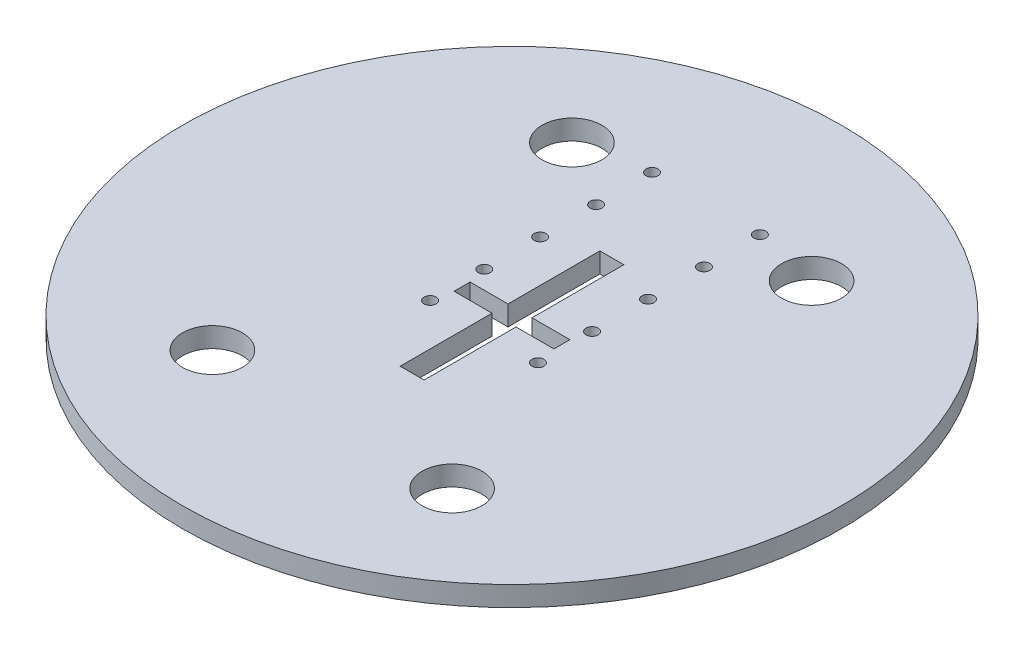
ISO-10303-21;
HEADER;
FILE_DESCRIPTION(('STEP AP214'),'2;1');
FILE_NAME('part.step','',(''),(''),'','','');
FILE_SCHEMA(('AUTOMOTIVE_DESIGN { 1 0 10303 214 1 1 1 1 }'));
ENDSEC;
DATA;
#1=APPLICATION_CONTEXT('core data for automotive mechanical design processes');
#2=APPLICATION_PROTOCOL_DEFINITION('international standard','automotive_design',2000,#1);
#3=PRODUCT_CONTEXT('',#1,'mechanical');
#4=PRODUCT('Part','Part','',(#3));
#5=PRODUCT_RELATED_PRODUCT_CATEGORY('part','',(#4));
#6=PRODUCT_DEFINITION_FORMATION('','',#4);
#7=PRODUCT_DEFINITION_CONTEXT('part definition',#1,'design');
#8=PRODUCT_DEFINITION('design','',#6,#7);
#9=PRODUCT_DEFINITION_SHAPE('','',#8);
#10=(LENGTH_UNIT() NAMED_UNIT(*) SI_UNIT(.MILLI.,.METRE.));
#11=(NAMED_UNIT(*) PLANE_ANGLE_UNIT() SI_UNIT($,.RADIAN.));
#12=(NAMED_UNIT(*) SI_UNIT($,.STERADIAN.) SOLID_ANGLE_UNIT());
#13=UNCERTAINTY_MEASURE_WITH_UNIT(LENGTH_MEASURE(1.E-05),#10,'distance_accuracy_value','');
#14=(GEOMETRIC_REPRESENTATION_CONTEXT(3) GLOBAL_UNCERTAINTY_ASSIGNED_CONTEXT((#13)) GLOBAL_UNIT_ASSIGNED_CONTEXT((#10,
#11,#12)) REPRESENTATION_CONTEXT('',''));
#15=CARTESIAN_POINT('',(0.,0.,0.));
#16=DIRECTION('',(0.,0.,1.));
#17=DIRECTION('',(1.,0.,0.));
#18=AXIS2_PLACEMENT_3D('',#15,#16,#17);
#19=CARTESIAN_POINT('',(-3.,0.,-25.));
#20=DIRECTION('',(-1.,0.,0.));
#21=DIRECTION('',(0.,0.,1.));
#22=AXIS2_PLACEMENT_3D('',#19,#20,#21);
#23=PLANE('',#22);
#24=DIRECTION('',(0.,0.,1.));
#25=VECTOR('',#24,1.);
#26=CARTESIAN_POINT('',(-3.,0.,-25.));
#27=LINE('',#26,#25);
#28=CARTESIAN_POINT('',(-3.,0.,2.));
#29=VERTEX_POINT('',#28);
#30=CARTESIAN_POINT('',(-3.,0.,25.));
#31=VERTEX_POINT('',#30);
#32=EDGE_CURVE('E186',#29,#31,#27,.T.);
#33=ORIENTED_EDGE('',*,*,#32,.F.);
#34=DIRECTION('',(0.,1.,0.));
#35=VECTOR('',#34,1.);
#36=CARTESIAN_POINT('',(-3.,0.,2.));
#37=LINE('',#36,#35);
#38=CARTESIAN_POINT('',(-3.,5.,2.));
#39=VERTEX_POINT('',#38);
#40=EDGE_CURVE('E178',#29,#39,#37,.T.);
#41=ORIENTED_EDGE('',*,*,#40,.T.);
#42=DIRECTION('',(0.,0.,1.));
#43=VECTOR('',#42,1.);
#44=CARTESIAN_POINT('',(-3.,5.,-25.));
#45=LINE('',#44,#43);
#46=CARTESIAN_POINT('',(-3.,5.,25.));
#47=VERTEX_POINT('',#46);
#48=EDGE_CURVE('E181',#39,#47,#45,.T.);
#49=ORIENTED_EDGE('',*,*,#48,.T.);
#50=DIRECTION('',(0.,1.,0.));
#51=VECTOR('',#50,1.);
#52=CARTESIAN_POINT('',(-3.,0.,25.));
#53=LINE('',#52,#51);
#54=EDGE_CURVE('E195',#31,#47,#53,.T.);
#55=ORIENTED_EDGE('',*,*,#54,.F.);
#56=EDGE_LOOP('',(#33,#41,#49,#55));
#57=FACE_BOUND('',#56,.T.);
#58=ADVANCED_FACE('F39',(#57),#23,.F.);
#59=CARTESIAN_POINT('',(3.,0.,-25.));
#60=DIRECTION('',(1.,0.,0.));
#61=DIRECTION('',(0.,0.,-1.));
#62=AXIS2_PLACEMENT_3D('',#59,#60,#61);
#63=PLANE('',#62);
#64=DIRECTION('',(0.,0.,-1.));
#65=VECTOR('',#64,1.);
#66=CARTESIAN_POINT('',(3.,5.,-25.));
#67=LINE('',#66,#65);
#68=CARTESIAN_POINT('',(3.,5.,25.));
#69=VERTEX_POINT('',#68);
#70=CARTESIAN_POINT('',(3.,5.,2.));
#71=VERTEX_POINT('',#70);
#72=EDGE_CURVE('E203',#69,#71,#67,.T.);
#73=ORIENTED_EDGE('',*,*,#72,.T.);
#74=DIRECTION('',(0.,-1.,0.));
#75=VECTOR('',#74,1.);
#76=CARTESIAN_POINT('',(3.,0.,2.));
#77=LINE('',#76,#75);
#78=CARTESIAN_POINT('',(3.,0.,2.));
#79=VERTEX_POINT('',#78);
#80=EDGE_CURVE('E11',#71,#79,#77,.T.);
#81=ORIENTED_EDGE('',*,*,#80,.T.);
#82=DIRECTION('',(0.,0.,-1.));
#83=VECTOR('',#82,1.);
#84=CARTESIAN_POINT('',(3.,0.,-25.));
#85=LINE('',#84,#83);
#86=CARTESIAN_POINT('',(3.,0.,25.));
#87=VERTEX_POINT('',#86);
#88=EDGE_CURVE('E190',#87,#79,#85,.T.);
#89=ORIENTED_EDGE('',*,*,#88,.F.);
#90=DIRECTION('',(0.,1.,0.));
#91=VECTOR('',#90,1.);
#92=CARTESIAN_POINT('',(3.,0.,25.));
#93=LINE('',#92,#91);
#94=EDGE_CURVE('E215',#87,#69,#93,.T.);
#95=ORIENTED_EDGE('',*,*,#94,.T.);
#96=EDGE_LOOP('',(#73,#81,#89,#95));
#97=FACE_BOUND('',#96,.T.);
#98=ADVANCED_FACE('F282',(#97),#63,.F.);
#99=CARTESIAN_POINT('',(0.,5.,0.));
#100=DIRECTION('',(0.,-1.,0.));
#101=DIRECTION('',(0.,0.,-1.));
#102=AXIS2_PLACEMENT_3D('',#99,#100,#101);
#103=CYLINDRICAL_SURFACE('',#102,82.5);
#104=CARTESIAN_POINT('',(0.,5.,0.));
#105=DIRECTION('',(0.,1.,0.));
#106=DIRECTION('',(0.,0.,1.));
#107=AXIS2_PLACEMENT_3D('',#104,#105,#106);
#108=CIRCLE('',#107,82.5);
#109=CARTESIAN_POINT('',(0.,5.,82.5));
#110=VERTEX_POINT('',#109);
#111=EDGE_CURVE('E243',#110,#110,#108,.T.);
#112=ORIENTED_EDGE('',*,*,#111,.F.);
#113=EDGE_LOOP('',(#112));
#114=FACE_BOUND('',#113,.T.);
#115=CARTESIAN_POINT('',(0.,0.,0.));
#116=DIRECTION('',(0.,1.,0.));
#117=DIRECTION('',(0.,0.,1.));
#118=AXIS2_PLACEMENT_3D('',#115,#116,#117);
#119=CIRCLE('',#118,82.5);
#120=CARTESIAN_POINT('',(0.,0.,82.5));
#121=VERTEX_POINT('',#120);
#122=EDGE_CURVE('E240',#121,#121,#119,.T.);
#123=ORIENTED_EDGE('',*,*,#122,.T.);
#124=EDGE_LOOP('',(#123));
#125=FACE_BOUND('',#124,.T.);
#126=ADVANCED_FACE('F41',(#114,#125),#103,.T.);
#127=CARTESIAN_POINT('',(0.,5.,0.));
#128=DIRECTION('',(0.,1.,0.));
#129=DIRECTION('',(0.,0.,1.));
#130=AXIS2_PLACEMENT_3D('',#127,#128,#129);
#131=PLANE('',#130);
#132=CARTESIAN_POINT('',(-13.5,5.,7.));
#133=DIRECTION('',(0.,1.,0.));
#134=DIRECTION('',(0.,0.,1.));
#135=AXIS2_PLACEMENT_3D('',#132,#133,#134);
#136=CIRCLE('',#135,1.5);
#137=CARTESIAN_POINT('',(-13.5,5.,8.5));
#138=VERTEX_POINT('',#137);
#139=EDGE_CURVE('E404',#138,#138,#136,.T.);
#140=ORIENTED_EDGE('',*,*,#139,.F.);
#141=EDGE_LOOP('',(#140));
#142=FACE_BOUND('',#141,.T.);
#143=CARTESIAN_POINT('',(-13.5,5.,-20.55));
#144=DIRECTION('',(0.,1.,0.));
#145=DIRECTION('',(0.,0.,1.));
#146=AXIS2_PLACEMENT_3D('',#143,#144,#145);
#147=CIRCLE('',#146,1.5);
#148=CARTESIAN_POINT('',(-13.5,5.,-19.05));
#149=VERTEX_POINT('',#148);
#150=EDGE_CURVE('E400',#149,#149,#147,.T.);
#151=ORIENTED_EDGE('',*,*,#150,.F.);
#152=EDGE_LOOP('',(#151));
#153=FACE_BOUND('',#152,.T.);
#154=CARTESIAN_POINT('',(-13.5,5.,-34.55));
#155=DIRECTION('',(0.,1.,0.));
#156=DIRECTION('',(0.,0.,1.));
#157=AXIS2_PLACEMENT_3D('',#154,#155,#156);
#158=CIRCLE('',#157,1.5);
#159=CARTESIAN_POINT('',(-13.5,5.,-33.05));
#160=VERTEX_POINT('',#159);
#161=EDGE_CURVE('E396',#160,#160,#158,.T.);
#162=ORIENTED_EDGE('',*,*,#161,.F.);
#163=EDGE_LOOP('',(#162));
#164=FACE_BOUND('',#163,.T.);
#165=CARTESIAN_POINT('',(-13.5,5.,-48.55));
#166=DIRECTION('',(0.,1.,0.));
#167=DIRECTION('',(0.,0.,1.));
#168=AXIS2_PLACEMENT_3D('',#165,#166,#167);
#169=CIRCLE('',#168,1.5);
#170=CARTESIAN_POINT('',(-13.5,5.,-47.05));
#171=VERTEX_POINT('',#170);
#172=EDGE_CURVE('E392',#171,#171,#169,.T.);
#173=ORIENTED_EDGE('',*,*,#172,.F.);
#174=EDGE_LOOP('',(#173));
#175=FACE_BOUND('',#174,.T.);
#176=CARTESIAN_POINT('',(13.5,5.,7.));
#177=DIRECTION('',(0.,1.,0.));
#178=DIRECTION('',(0.,0.,-1.));
#179=AXIS2_PLACEMENT_3D('',#176,#177,#178);
#180=CIRCLE('',#179,1.5);
#181=CARTESIAN_POINT('',(13.5,5.,5.5));
#182=VERTEX_POINT('',#181);
#183=EDGE_CURVE('E388',#182,#182,#180,.T.);
#184=ORIENTED_EDGE('',*,*,#183,.F.);
#185=EDGE_LOOP('',(#184));
#186=FACE_BOUND('',#185,.T.);
#187=CARTESIAN_POINT('',(13.5,5.,-6.55));
#188=DIRECTION('',(0.,1.,0.));
#189=DIRECTION('',(0.,0.,-1.));
#190=AXIS2_PLACEMENT_3D('',#187,#188,#189);
#191=CIRCLE('',#190,1.5);
#192=CARTESIAN_POINT('',(13.5,5.,-8.05));
#193=VERTEX_POINT('',#192);
#194=EDGE_CURVE('E384',#193,#193,#191,.T.);
#195=ORIENTED_EDGE('',*,*,#194,.F.);
#196=EDGE_LOOP('',(#195));
#197=FACE_BOUND('',#196,.T.);
#198=CARTESIAN_POINT('',(13.5,5.,-20.55));
#199=DIRECTION('',(0.,1.,0.));
#200=DIRECTION('',(0.,0.,-1.));
#201=AXIS2_PLACEMENT_3D('',#198,#199,#200);
#202=CIRCLE('',#201,1.5);
#203=CARTESIAN_POINT('',(13.5,5.,-22.05));
#204=VERTEX_POINT('',#203);
#205=EDGE_CURVE('E380',#204,#204,#202,.T.);
#206=ORIENTED_EDGE('',*,*,#205,.F.);
#207=EDGE_LOOP('',(#206));
#208=FACE_BOUND('',#207,.T.);
#209=CARTESIAN_POINT('',(13.5,5.,-34.55));
#210=DIRECTION('',(0.,1.,0.));
#211=DIRECTION('',(0.,0.,-1.));
#212=AXIS2_PLACEMENT_3D('',#209,#210,#211);
#213=CIRCLE('',#212,1.5);
#214=CARTESIAN_POINT('',(13.5,5.,-36.05));
#215=VERTEX_POINT('',#214);
#216=EDGE_CURVE('E376',#215,#215,#213,.T.);
#217=ORIENTED_EDGE('',*,*,#216,.F.);
#218=EDGE_LOOP('',(#217));
#219=FACE_BOUND('',#218,.T.);
#220=CARTESIAN_POINT('',(13.5,5.,-48.55));
#221=DIRECTION('',(0.,1.,0.));
#222=DIRECTION('',(0.,0.,-1.));
#223=AXIS2_PLACEMENT_3D('',#220,#221,#222);
#224=CIRCLE('',#223,1.5);
#225=CARTESIAN_POINT('',(13.5,5.,-50.05));
#226=VERTEX_POINT('',#225);
#227=EDGE_CURVE('E408',#226,#226,#224,.T.);
#228=ORIENTED_EDGE('',*,*,#227,.F.);
#229=EDGE_LOOP('',(#228));
#230=FACE_BOUND('',#229,.T.);
#231=CARTESIAN_POINT('',(-13.5,5.,-6.55));
#232=DIRECTION('',(0.,1.,0.));
#233=DIRECTION('',(0.,0.,1.));
#234=AXIS2_PLACEMENT_3D('',#231,#232,#233);
#235=CIRCLE('',#234,1.5);
#236=CARTESIAN_POINT('',(-13.5,5.,-5.05));
#237=VERTEX_POINT('',#236);
#238=EDGE_CURVE('E156',#237,#237,#235,.T.);
#239=ORIENTED_EDGE('',*,*,#238,.F.);
#240=EDGE_LOOP('',(#239));
#241=FACE_BOUND('',#240,.T.);
#242=DIRECTION('',(1.,0.,0.));
#243=VECTOR('',#242,1.);
#244=CARTESIAN_POINT('',(-12.5,5.,2.));
#245=LINE('',#244,#243);
#246=CARTESIAN_POINT('',(12.5,5.,2.));
#247=VERTEX_POINT('',#246);
#248=EDGE_CURVE('E153',#71,#247,#245,.T.);
#249=ORIENTED_EDGE('',*,*,#248,.F.);
#250=ORIENTED_EDGE('',*,*,#72,.F.);
#251=DIRECTION('',(1.,0.,0.));
#252=VECTOR('',#251,1.);
#253=CARTESIAN_POINT('',(3.,5.,25.));
#254=LINE('',#253,#252);
#255=EDGE_CURVE('E199',#47,#69,#254,.T.);
#256=ORIENTED_EDGE('',*,*,#255,.F.);
#257=ORIENTED_EDGE('',*,*,#48,.F.);
#258=CARTESIAN_POINT('',(-12.5,5.,2.));
#259=VERTEX_POINT('',#258);
#260=EDGE_CURVE('E151',#259,#39,#245,.T.);
#261=ORIENTED_EDGE('',*,*,#260,.F.);
#262=DIRECTION('',(0.,0.,1.));
#263=VECTOR('',#262,1.);
#264=CARTESIAN_POINT('',(-12.5,5.,-2.));
#265=LINE('',#264,#263);
#266=CARTESIAN_POINT('',(-12.5,5.,-2.));
#267=VERTEX_POINT('',#266);
#268=EDGE_CURVE('E167',#267,#259,#265,.T.);
#269=ORIENTED_EDGE('',*,*,#268,.F.);
#270=DIRECTION('',(-1.,0.,0.));
#271=VECTOR('',#270,1.);
#272=CARTESIAN_POINT('',(-12.5,5.,-2.));
#273=LINE('',#272,#271);
#274=CARTESIAN_POINT('',(-3.,5.,-2.));
#275=VERTEX_POINT('',#274);
#276=EDGE_CURVE('E164',#275,#267,#273,.T.);
#277=ORIENTED_EDGE('',*,*,#276,.F.);
#278=CARTESIAN_POINT('',(-3.,5.,-25.));
#279=VERTEX_POINT('',#278);
#280=EDGE_CURVE('E196',#279,#275,#45,.T.);
#281=ORIENTED_EDGE('',*,*,#280,.F.);
#282=DIRECTION('',(-1.,0.,0.));
#283=VECTOR('',#282,1.);
#284=CARTESIAN_POINT('',(3.,5.,-25.));
#285=LINE('',#284,#283);
#286=CARTESIAN_POINT('',(3.,5.,-25.));
#287=VERTEX_POINT('',#286);
#288=EDGE_CURVE('E206',#287,#279,#285,.T.);
#289=ORIENTED_EDGE('',*,*,#288,.F.);
#290=CARTESIAN_POINT('',(3.,5.,-2.));
#291=VERTEX_POINT('',#290);
#292=EDGE_CURVE('E202',#291,#287,#67,.T.);
#293=ORIENTED_EDGE('',*,*,#292,.F.);
#294=CARTESIAN_POINT('',(12.5,5.,-2.));
#295=VERTEX_POINT('',#294);
#296=EDGE_CURVE('E62',#295,#291,#273,.T.);
#297=ORIENTED_EDGE('',*,*,#296,.F.);
#298=DIRECTION('',(0.,0.,-1.));
#299=VECTOR('',#298,1.);
#300=CARTESIAN_POINT('',(12.5,5.,-2.));
#301=LINE('',#300,#299);
#302=EDGE_CURVE('E136',#247,#295,#301,.T.);
#303=ORIENTED_EDGE('',*,*,#302,.F.);
#304=EDGE_LOOP('',(#249,#250,#256,#257,#261,#269,#277,#281,#289,#293,#297,#303));
#305=FACE_BOUND('',#304,.T.);
#306=CARTESIAN_POINT('',(-30.,5.,45.));
#307=DIRECTION('',(0.,1.,0.));
#308=DIRECTION('',(0.,0.,-1.));
#309=AXIS2_PLACEMENT_3D('',#306,#307,#308);
#310=CIRCLE('',#309,7.49999999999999);
#311=CARTESIAN_POINT('',(-30.,5.,37.5));
#312=VERTEX_POINT('',#311);
#313=EDGE_CURVE('E229',#312,#312,#310,.T.);
#314=ORIENTED_EDGE('',*,*,#313,.F.);
#315=EDGE_LOOP('',(#314));
#316=FACE_BOUND('',#315,.T.);
#317=CARTESIAN_POINT('',(30.,5.,-45.));
#318=DIRECTION('',(0.,1.,0.));
#319=DIRECTION('',(0.,0.,-1.));
#320=AXIS2_PLACEMENT_3D('',#317,#318,#319);
#321=CIRCLE('',#320,7.49999999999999);
#322=CARTESIAN_POINT('',(30.,5.,-52.5));
#323=VERTEX_POINT('',#322);
#324=EDGE_CURVE('E222',#323,#323,#321,.T.);
#325=ORIENTED_EDGE('',*,*,#324,.F.);
#326=EDGE_LOOP('',(#325));
#327=FACE_BOUND('',#326,.T.);
#328=CARTESIAN_POINT('',(-30.,5.,-45.));
#329=DIRECTION('',(0.,1.,0.));
#330=DIRECTION('',(0.,0.,1.));
#331=AXIS2_PLACEMENT_3D('',#328,#329,#330);
#332=CIRCLE('',#331,7.49999999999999);
#333=CARTESIAN_POINT('',(-30.,5.,-37.5));
#334=VERTEX_POINT('',#333);
#335=EDGE_CURVE('E211',#334,#334,#332,.T.);
#336=ORIENTED_EDGE('',*,*,#335,.F.);
#337=EDGE_LOOP('',(#336));
#338=FACE_BOUND('',#337,.T.);
#339=CARTESIAN_POINT('',(30.,5.,45.));
#340=DIRECTION('',(0.,1.,0.));
#341=DIRECTION('',(0.,0.,1.));
#342=AXIS2_PLACEMENT_3D('',#339,#340,#341);
#343=CIRCLE('',#342,7.49999999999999);
#344=CARTESIAN_POINT('',(30.,5.,52.5));
#345=VERTEX_POINT('',#344);
#346=EDGE_CURVE('E228',#345,#345,#343,.T.);
#347=ORIENTED_EDGE('',*,*,#346,.F.);
#348=EDGE_LOOP('',(#347));
#349=FACE_BOUND('',#348,.T.);
#350=ORIENTED_EDGE('',*,*,#111,.T.);
#351=EDGE_LOOP('',(#350));
#352=FACE_BOUND('',#351,.T.);
#353=ADVANCED_FACE('F254',(#142,#153,#164,#175,#186,#197,#208,#219,#230,#241,#305,#316,#327,
#338,#349,#352),#131,.T.);
#354=CARTESIAN_POINT('',(0.,0.,0.));
#355=DIRECTION('',(0.,1.,0.));
#356=DIRECTION('',(0.,0.,1.));
#357=AXIS2_PLACEMENT_3D('',#354,#355,#356);
#358=PLANE('',#357);
#359=CARTESIAN_POINT('',(-13.5,0.,7.));
#360=DIRECTION('',(0.,1.,0.));
#361=DIRECTION('',(0.,0.,1.));
#362=AXIS2_PLACEMENT_3D('',#359,#360,#361);
#363=CIRCLE('',#362,1.5);
#364=CARTESIAN_POINT('',(-13.5,0.,8.5));
#365=VERTEX_POINT('',#364);
#366=EDGE_CURVE('E338',#365,#365,#363,.T.);
#367=ORIENTED_EDGE('',*,*,#366,.T.);
#368=EDGE_LOOP('',(#367));
#369=FACE_BOUND('',#368,.T.);
#370=CARTESIAN_POINT('',(-13.5,0.,-20.55));
#371=DIRECTION('',(0.,1.,0.));
#372=DIRECTION('',(0.,0.,1.));
#373=AXIS2_PLACEMENT_3D('',#370,#371,#372);
#374=CIRCLE('',#373,1.5);
#375=CARTESIAN_POINT('',(-13.5,0.,-19.05));
#376=VERTEX_POINT('',#375);
#377=EDGE_CURVE('E342',#376,#376,#374,.T.);
#378=ORIENTED_EDGE('',*,*,#377,.T.);
#379=EDGE_LOOP('',(#378));
#380=FACE_BOUND('',#379,.T.);
#381=CARTESIAN_POINT('',(-13.5,0.,-34.55));
#382=DIRECTION('',(0.,1.,0.));
#383=DIRECTION('',(0.,0.,1.));
#384=AXIS2_PLACEMENT_3D('',#381,#382,#383);
#385=CIRCLE('',#384,1.5);
#386=CARTESIAN_POINT('',(-13.5,0.,-33.05));
#387=VERTEX_POINT('',#386);
#388=EDGE_CURVE('E346',#387,#387,#385,.T.);
#389=ORIENTED_EDGE('',*,*,#388,.T.);
#390=EDGE_LOOP('',(#389));
#391=FACE_BOUND('',#390,.T.);
#392=CARTESIAN_POINT('',(-13.5,0.,-48.55));
#393=DIRECTION('',(0.,1.,0.));
#394=DIRECTION('',(0.,0.,1.));
#395=AXIS2_PLACEMENT_3D('',#392,#393,#394);
#396=CIRCLE('',#395,1.5);
#397=CARTESIAN_POINT('',(-13.5,0.,-47.05));
#398=VERTEX_POINT('',#397);
#399=EDGE_CURVE('E350',#398,#398,#396,.T.);
#400=ORIENTED_EDGE('',*,*,#399,.T.);
#401=EDGE_LOOP('',(#400));
#402=FACE_BOUND('',#401,.T.);
#403=CARTESIAN_POINT('',(13.5,0.,7.));
#404=DIRECTION('',(0.,1.,0.));
#405=DIRECTION('',(0.,0.,-1.));
#406=AXIS2_PLACEMENT_3D('',#403,#404,#405);
#407=CIRCLE('',#406,1.5);
#408=CARTESIAN_POINT('',(13.5,0.,5.5));
#409=VERTEX_POINT('',#408);
#410=EDGE_CURVE('E354',#409,#409,#407,.T.);
#411=ORIENTED_EDGE('',*,*,#410,.T.);
#412=EDGE_LOOP('',(#411));
#413=FACE_BOUND('',#412,.T.);
#414=CARTESIAN_POINT('',(13.5,0.,-6.55));
#415=DIRECTION('',(0.,1.,0.));
#416=DIRECTION('',(0.,0.,-1.));
#417=AXIS2_PLACEMENT_3D('',#414,#415,#416);
#418=CIRCLE('',#417,1.5);
#419=CARTESIAN_POINT('',(13.5,0.,-8.05));
#420=VERTEX_POINT('',#419);
#421=EDGE_CURVE('E358',#420,#420,#418,.T.);
#422=ORIENTED_EDGE('',*,*,#421,.T.);
#423=EDGE_LOOP('',(#422));
#424=FACE_BOUND('',#423,.T.);
#425=CARTESIAN_POINT('',(13.5,0.,-20.55));
#426=DIRECTION('',(0.,1.,0.));
#427=DIRECTION('',(0.,0.,-1.));
#428=AXIS2_PLACEMENT_3D('',#425,#426,#427);
#429=CIRCLE('',#428,1.5);
#430=CARTESIAN_POINT('',(13.5,0.,-22.05));
#431=VERTEX_POINT('',#430);
#432=EDGE_CURVE('E362',#431,#431,#429,.T.);
#433=ORIENTED_EDGE('',*,*,#432,.T.);
#434=EDGE_LOOP('',(#433));
#435=FACE_BOUND('',#434,.T.);
#436=CARTESIAN_POINT('',(13.5,0.,-34.55));
#437=DIRECTION('',(0.,1.,0.));
#438=DIRECTION('',(0.,0.,-1.));
#439=AXIS2_PLACEMENT_3D('',#436,#437,#438);
#440=CIRCLE('',#439,1.5);
#441=CARTESIAN_POINT('',(13.5,0.,-36.05));
#442=VERTEX_POINT('',#441);
#443=EDGE_CURVE('E366',#442,#442,#440,.T.);
#444=ORIENTED_EDGE('',*,*,#443,.T.);
#445=EDGE_LOOP('',(#444));
#446=FACE_BOUND('',#445,.T.);
#447=CARTESIAN_POINT('',(13.5,0.,-48.55));
#448=DIRECTION('',(0.,1.,0.));
#449=DIRECTION('',(0.,0.,-1.));
#450=AXIS2_PLACEMENT_3D('',#447,#448,#449);
#451=CIRCLE('',#450,1.5);
#452=CARTESIAN_POINT('',(13.5,0.,-50.05));
#453=VERTEX_POINT('',#452);
#454=EDGE_CURVE('E370',#453,#453,#451,.T.);
#455=ORIENTED_EDGE('',*,*,#454,.T.);
#456=EDGE_LOOP('',(#455));
#457=FACE_BOUND('',#456,.T.);
#458=CARTESIAN_POINT('',(-13.5,0.,-6.55));
#459=DIRECTION('',(0.,1.,0.));
#460=DIRECTION('',(0.,0.,1.));
#461=AXIS2_PLACEMENT_3D('',#458,#459,#460);
#462=CIRCLE('',#461,1.5);
#463=CARTESIAN_POINT('',(-13.5,0.,-5.05));
#464=VERTEX_POINT('',#463);
#465=EDGE_CURVE('E165',#464,#464,#462,.T.);
#466=ORIENTED_EDGE('',*,*,#465,.T.);
#467=EDGE_LOOP('',(#466));
#468=FACE_BOUND('',#467,.T.);
#469=ORIENTED_EDGE('',*,*,#88,.T.);
#470=DIRECTION('',(1.,0.,0.));
#471=VECTOR('',#470,1.);
#472=CARTESIAN_POINT('',(-12.5,0.,2.));
#473=LINE('',#472,#471);
#474=CARTESIAN_POINT('',(12.5,0.,2.));
#475=VERTEX_POINT('',#474);
#476=EDGE_CURVE('E150',#79,#475,#473,.T.);
#477=ORIENTED_EDGE('',*,*,#476,.T.);
#478=DIRECTION('',(0.,0.,-1.));
#479=VECTOR('',#478,1.);
#480=CARTESIAN_POINT('',(12.5,0.,-2.));
#481=LINE('',#480,#479);
#482=CARTESIAN_POINT('',(12.5,0.,-2.));
#483=VERTEX_POINT('',#482);
#484=EDGE_CURVE('E133',#475,#483,#481,.T.);
#485=ORIENTED_EDGE('',*,*,#484,.T.);
#486=DIRECTION('',(-1.,0.,0.));
#487=VECTOR('',#486,1.);
#488=CARTESIAN_POINT('',(-12.5,0.,-2.));
#489=LINE('',#488,#487);
#490=CARTESIAN_POINT('',(3.,0.,-2.));
#491=VERTEX_POINT('',#490);
#492=EDGE_CURVE('E141',#483,#491,#489,.T.);
#493=ORIENTED_EDGE('',*,*,#492,.T.);
#494=CARTESIAN_POINT('',(3.,0.,-25.));
#495=VERTEX_POINT('',#494);
#496=EDGE_CURVE('E189',#491,#495,#85,.T.);
#497=ORIENTED_EDGE('',*,*,#496,.T.);
#498=DIRECTION('',(-1.,0.,0.));
#499=VECTOR('',#498,1.);
#500=CARTESIAN_POINT('',(3.,0.,-25.));
#501=LINE('',#500,#499);
#502=CARTESIAN_POINT('',(-3.,0.,-25.));
#503=VERTEX_POINT('',#502);
#504=EDGE_CURVE('E192',#495,#503,#501,.T.);
#505=ORIENTED_EDGE('',*,*,#504,.T.);
#506=CARTESIAN_POINT('',(-3.,0.,-2.));
#507=VERTEX_POINT('',#506);
#508=EDGE_CURVE('E182',#503,#507,#27,.T.);
#509=ORIENTED_EDGE('',*,*,#508,.T.);
#510=CARTESIAN_POINT('',(-12.5,0.,-2.));
#511=VERTEX_POINT('',#510);
#512=EDGE_CURVE('E54',#507,#511,#489,.T.);
#513=ORIENTED_EDGE('',*,*,#512,.T.);
#514=DIRECTION('',(0.,0.,1.));
#515=VECTOR('',#514,1.);
#516=CARTESIAN_POINT('',(-12.5,0.,-2.));
#517=LINE('',#516,#515);
#518=CARTESIAN_POINT('',(-12.5,0.,2.));
#519=VERTEX_POINT('',#518);
#520=EDGE_CURVE('E145',#511,#519,#517,.T.);
#521=ORIENTED_EDGE('',*,*,#520,.T.);
#522=EDGE_CURVE('E138',#519,#29,#473,.T.);
#523=ORIENTED_EDGE('',*,*,#522,.T.);
#524=ORIENTED_EDGE('',*,*,#32,.T.);
#525=DIRECTION('',(1.,0.,0.));
#526=VECTOR('',#525,1.);
#527=CARTESIAN_POINT('',(3.,0.,25.));
#528=LINE('',#527,#526);
#529=EDGE_CURVE('E185',#31,#87,#528,.T.);
#530=ORIENTED_EDGE('',*,*,#529,.T.);
#531=EDGE_LOOP('',(#469,#477,#485,#493,#497,#505,#509,#513,#521,#523,#524,#530));
#532=FACE_BOUND('',#531,.T.);
#533=CARTESIAN_POINT('',(-30.,0.,45.));
#534=DIRECTION('',(0.,1.,0.));
#535=DIRECTION('',(0.,0.,-1.));
#536=AXIS2_PLACEMENT_3D('',#533,#534,#535);
#537=CIRCLE('',#536,7.49999999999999);
#538=CARTESIAN_POINT('',(-30.,0.,37.5));
#539=VERTEX_POINT('',#538);
#540=EDGE_CURVE('E225',#539,#539,#537,.T.);
#541=ORIENTED_EDGE('',*,*,#540,.T.);
#542=EDGE_LOOP('',(#541));
#543=FACE_BOUND('',#542,.T.);
#544=CARTESIAN_POINT('',(30.,0.,-45.));
#545=DIRECTION('',(0.,1.,0.));
#546=DIRECTION('',(0.,0.,-1.));
#547=AXIS2_PLACEMENT_3D('',#544,#545,#546);
#548=CIRCLE('',#547,7.49999999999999);
#549=CARTESIAN_POINT('',(30.,0.,-52.5));
#550=VERTEX_POINT('',#549);
#551=EDGE_CURVE('E232',#550,#550,#548,.T.);
#552=ORIENTED_EDGE('',*,*,#551,.T.);
#553=EDGE_LOOP('',(#552));
#554=FACE_BOUND('',#553,.T.);
#555=CARTESIAN_POINT('',(-30.,0.,-45.));
#556=DIRECTION('',(0.,1.,0.));
#557=DIRECTION('',(0.,0.,1.));
#558=AXIS2_PLACEMENT_3D('',#555,#556,#557);
#559=CIRCLE('',#558,7.49999999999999);
#560=CARTESIAN_POINT('',(-30.,0.,-37.5));
#561=VERTEX_POINT('',#560);
#562=EDGE_CURVE('E219',#561,#561,#559,.T.);
#563=ORIENTED_EDGE('',*,*,#562,.T.);
#564=EDGE_LOOP('',(#563));
#565=FACE_BOUND('',#564,.T.);
#566=CARTESIAN_POINT('',(30.,0.,45.));
#567=DIRECTION('',(0.,1.,0.));
#568=DIRECTION('',(0.,0.,1.));
#569=AXIS2_PLACEMENT_3D('',#566,#567,#568);
#570=CIRCLE('',#569,7.49999999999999);
#571=CARTESIAN_POINT('',(30.,0.,52.5));
#572=VERTEX_POINT('',#571);
#573=EDGE_CURVE('E237',#572,#572,#570,.T.);
#574=ORIENTED_EDGE('',*,*,#573,.T.);
#575=EDGE_LOOP('',(#574));
#576=FACE_BOUND('',#575,.T.);
#577=ORIENTED_EDGE('',*,*,#122,.F.);
#578=EDGE_LOOP('',(#577));
#579=FACE_BOUND('',#578,.T.);
#580=ADVANCED_FACE('F148',(#369,#380,#391,#402,#413,#424,#435,#446,#457,#468,#532,#543,#554,
#565,#576,#579),#358,.F.);
#581=CARTESIAN_POINT('',(30.,0.,45.));
#582=DIRECTION('',(0.,1.,0.));
#583=DIRECTION('',(0.,0.,1.));
#584=AXIS2_PLACEMENT_3D('',#581,#582,#583);
#585=CYLINDRICAL_SURFACE('',#584,7.49999999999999);
#586=ORIENTED_EDGE('',*,*,#573,.F.);
#587=EDGE_LOOP('',(#586));
#588=FACE_BOUND('',#587,.T.);
#589=ORIENTED_EDGE('',*,*,#346,.T.);
#590=EDGE_LOOP('',(#589));
#591=FACE_BOUND('',#590,.T.);
#592=ADVANCED_FACE('F325',(#588,#591),#585,.F.);
#593=CARTESIAN_POINT('',(-30.,0.,-45.));
#594=DIRECTION('',(0.,1.,0.));
#595=DIRECTION('',(0.,0.,1.));
#596=AXIS2_PLACEMENT_3D('',#593,#594,#595);
#597=CYLINDRICAL_SURFACE('',#596,7.49999999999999);
#598=ORIENTED_EDGE('',*,*,#562,.F.);
#599=EDGE_LOOP('',(#598));
#600=FACE_BOUND('',#599,.T.);
#601=ORIENTED_EDGE('',*,*,#335,.T.);
#602=EDGE_LOOP('',(#601));
#603=FACE_BOUND('',#602,.T.);
#604=ADVANCED_FACE('F319',(#600,#603),#597,.F.);
#605=CARTESIAN_POINT('',(30.,0.,-45.));
#606=DIRECTION('',(0.,1.,0.));
#607=DIRECTION('',(0.,0.,1.));
#608=AXIS2_PLACEMENT_3D('',#605,#606,#607);
#609=CYLINDRICAL_SURFACE('',#608,7.49999999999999);
#610=ORIENTED_EDGE('',*,*,#551,.F.);
#611=EDGE_LOOP('',(#610));
#612=FACE_BOUND('',#611,.T.);
#613=ORIENTED_EDGE('',*,*,#324,.T.);
#614=EDGE_LOOP('',(#613));
#615=FACE_BOUND('',#614,.T.);
#616=ADVANCED_FACE('F313',(#612,#615),#609,.F.);
#617=CARTESIAN_POINT('',(-30.,0.,45.));
#618=DIRECTION('',(0.,1.,0.));
#619=DIRECTION('',(0.,0.,1.));
#620=AXIS2_PLACEMENT_3D('',#617,#618,#619);
#621=CYLINDRICAL_SURFACE('',#620,7.49999999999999);
#622=ORIENTED_EDGE('',*,*,#540,.F.);
#623=EDGE_LOOP('',(#622));
#624=FACE_BOUND('',#623,.T.);
#625=ORIENTED_EDGE('',*,*,#313,.T.);
#626=EDGE_LOOP('',(#625));
#627=FACE_BOUND('',#626,.T.);
#628=ADVANCED_FACE('F307',(#624,#627),#621,.F.);
#629=ORIENTED_EDGE('',*,*,#280,.T.);
#630=DIRECTION('',(0.,-1.,0.));
#631=VECTOR('',#630,1.);
#632=CARTESIAN_POINT('',(-3.,0.,-2.));
#633=LINE('',#632,#631);
#634=EDGE_CURVE('E172',#275,#507,#633,.T.);
#635=ORIENTED_EDGE('',*,*,#634,.T.);
#636=ORIENTED_EDGE('',*,*,#508,.F.);
#637=DIRECTION('',(0.,1.,0.));
#638=VECTOR('',#637,1.);
#639=CARTESIAN_POINT('',(-3.,0.,-25.));
#640=LINE('',#639,#638);
#641=EDGE_CURVE('E209',#503,#279,#640,.T.);
#642=ORIENTED_EDGE('',*,*,#641,.T.);
#643=EDGE_LOOP('',(#629,#635,#636,#642));
#644=FACE_BOUND('',#643,.T.);
#645=ADVANCED_FACE('F263',(#644),#23,.F.);
#646=CARTESIAN_POINT('',(3.,0.,-25.));
#647=DIRECTION('',(0.,0.,-1.));
#648=DIRECTION('',(-1.,0.,0.));
#649=AXIS2_PLACEMENT_3D('',#646,#647,#648);
#650=PLANE('',#649);
#651=ORIENTED_EDGE('',*,*,#288,.T.);
#652=ORIENTED_EDGE('',*,*,#641,.F.);
#653=ORIENTED_EDGE('',*,*,#504,.F.);
#654=DIRECTION('',(0.,1.,0.));
#655=VECTOR('',#654,1.);
#656=CARTESIAN_POINT('',(3.,0.,-25.));
#657=LINE('',#656,#655);
#658=EDGE_CURVE('E212',#495,#287,#657,.T.);
#659=ORIENTED_EDGE('',*,*,#658,.T.);
#660=EDGE_LOOP('',(#651,#652,#653,#659));
#661=FACE_BOUND('',#660,.T.);
#662=ADVANCED_FACE('F259',(#661),#650,.F.);
#663=ORIENTED_EDGE('',*,*,#496,.F.);
#664=DIRECTION('',(0.,1.,0.));
#665=VECTOR('',#664,1.);
#666=CARTESIAN_POINT('',(3.,0.,-2.));
#667=LINE('',#666,#665);
#668=EDGE_CURVE('E47',#491,#291,#667,.T.);
#669=ORIENTED_EDGE('',*,*,#668,.T.);
#670=ORIENTED_EDGE('',*,*,#292,.T.);
#671=ORIENTED_EDGE('',*,*,#658,.F.);
#672=EDGE_LOOP('',(#663,#669,#670,#671));
#673=FACE_BOUND('',#672,.T.);
#674=ADVANCED_FACE('F249',(#673),#63,.F.);
#675=CARTESIAN_POINT('',(3.,0.,25.));
#676=DIRECTION('',(0.,0.,1.));
#677=DIRECTION('',(1.,0.,0.));
#678=AXIS2_PLACEMENT_3D('',#675,#676,#677);
#679=PLANE('',#678);
#680=ORIENTED_EDGE('',*,*,#255,.T.);
#681=ORIENTED_EDGE('',*,*,#94,.F.);
#682=ORIENTED_EDGE('',*,*,#529,.F.);
#683=ORIENTED_EDGE('',*,*,#54,.T.);
#684=EDGE_LOOP('',(#680,#681,#682,#683));
#685=FACE_BOUND('',#684,.T.);
#686=ADVANCED_FACE('F280',(#685),#679,.F.);
#687=CARTESIAN_POINT('',(-12.5,0.,-2.));
#688=DIRECTION('',(0.,0.,-1.));
#689=DIRECTION('',(-1.,0.,0.));
#690=AXIS2_PLACEMENT_3D('',#687,#688,#689);
#691=PLANE('',#690);
#692=ORIENTED_EDGE('',*,*,#492,.F.);
#693=DIRECTION('',(0.,1.,0.));
#694=VECTOR('',#693,1.);
#695=CARTESIAN_POINT('',(12.5,0.,-2.));
#696=LINE('',#695,#694);
#697=EDGE_CURVE('E128',#483,#295,#696,.T.);
#698=ORIENTED_EDGE('',*,*,#697,.T.);
#699=ORIENTED_EDGE('',*,*,#296,.T.);
#700=ORIENTED_EDGE('',*,*,#668,.F.);
#701=EDGE_LOOP('',(#692,#698,#699,#700));
#702=FACE_BOUND('',#701,.T.);
#703=ADVANCED_FACE('F142',(#702),#691,.F.);
#704=CARTESIAN_POINT('',(-12.5,0.,2.));
#705=DIRECTION('',(0.,0.,1.));
#706=DIRECTION('',(1.,0.,0.));
#707=AXIS2_PLACEMENT_3D('',#704,#705,#706);
#708=PLANE('',#707);
#709=ORIENTED_EDGE('',*,*,#248,.T.);
#710=DIRECTION('',(0.,1.,0.));
#711=VECTOR('',#710,1.);
#712=CARTESIAN_POINT('',(12.5,0.,2.));
#713=LINE('',#712,#711);
#714=EDGE_CURVE('E170',#475,#247,#713,.T.);
#715=ORIENTED_EDGE('',*,*,#714,.F.);
#716=ORIENTED_EDGE('',*,*,#476,.F.);
#717=ORIENTED_EDGE('',*,*,#80,.F.);
#718=EDGE_LOOP('',(#709,#715,#716,#717));
#719=FACE_BOUND('',#718,.T.);
#720=ADVANCED_FACE('F285',(#719),#708,.F.);
#721=CARTESIAN_POINT('',(12.5,0.,-2.));
#722=DIRECTION('',(1.,0.,0.));
#723=DIRECTION('',(0.,0.,-1.));
#724=AXIS2_PLACEMENT_3D('',#721,#722,#723);
#725=PLANE('',#724);
#726=ORIENTED_EDGE('',*,*,#302,.T.);
#727=ORIENTED_EDGE('',*,*,#697,.F.);
#728=ORIENTED_EDGE('',*,*,#484,.F.);
#729=ORIENTED_EDGE('',*,*,#714,.T.);
#730=EDGE_LOOP('',(#726,#727,#728,#729));
#731=FACE_BOUND('',#730,.T.);
#732=ADVANCED_FACE('F130',(#731),#725,.F.);
#733=ORIENTED_EDGE('',*,*,#522,.F.);
#734=DIRECTION('',(0.,1.,0.));
#735=VECTOR('',#734,1.);
#736=CARTESIAN_POINT('',(-12.5,0.,2.));
#737=LINE('',#736,#735);
#738=EDGE_CURVE('E173',#519,#259,#737,.T.);
#739=ORIENTED_EDGE('',*,*,#738,.T.);
#740=ORIENTED_EDGE('',*,*,#260,.T.);
#741=ORIENTED_EDGE('',*,*,#40,.F.);
#742=EDGE_LOOP('',(#733,#739,#740,#741));
#743=FACE_BOUND('',#742,.T.);
#744=ADVANCED_FACE('F288',(#743),#708,.F.);
#745=ORIENTED_EDGE('',*,*,#276,.T.);
#746=DIRECTION('',(0.,1.,0.));
#747=VECTOR('',#746,1.);
#748=CARTESIAN_POINT('',(-12.5,0.,-2.));
#749=LINE('',#748,#747);
#750=EDGE_CURVE('E137',#511,#267,#749,.T.);
#751=ORIENTED_EDGE('',*,*,#750,.F.);
#752=ORIENTED_EDGE('',*,*,#512,.F.);
#753=ORIENTED_EDGE('',*,*,#634,.F.);
#754=EDGE_LOOP('',(#745,#751,#752,#753));
#755=FACE_BOUND('',#754,.T.);
#756=ADVANCED_FACE('F264',(#755),#691,.F.);
#757=CARTESIAN_POINT('',(-12.5,0.,-2.));
#758=DIRECTION('',(-1.,0.,0.));
#759=DIRECTION('',(0.,0.,1.));
#760=AXIS2_PLACEMENT_3D('',#757,#758,#759);
#761=PLANE('',#760);
#762=ORIENTED_EDGE('',*,*,#268,.T.);
#763=ORIENTED_EDGE('',*,*,#738,.F.);
#764=ORIENTED_EDGE('',*,*,#520,.F.);
#765=ORIENTED_EDGE('',*,*,#750,.T.);
#766=EDGE_LOOP('',(#762,#763,#764,#765));
#767=FACE_BOUND('',#766,.T.);
#768=ADVANCED_FACE('F269',(#767),#761,.F.);
#769=CARTESIAN_POINT('',(-13.5,0.,-6.55));
#770=DIRECTION('',(0.,1.,0.));
#771=DIRECTION('',(0.,0.,1.));
#772=AXIS2_PLACEMENT_3D('',#769,#770,#771);
#773=CYLINDRICAL_SURFACE('',#772,1.5);
#774=ORIENTED_EDGE('',*,*,#465,.F.);
#775=EDGE_LOOP('',(#774));
#776=FACE_BOUND('',#775,.T.);
#777=ORIENTED_EDGE('',*,*,#238,.T.);
#778=EDGE_LOOP('',(#777));
#779=FACE_BOUND('',#778,.T.);
#780=ADVANCED_FACE('F418',(#776,#779),#773,.F.);
#781=CARTESIAN_POINT('',(13.5,0.,-48.55));
#782=DIRECTION('',(0.,1.,0.));
#783=DIRECTION('',(0.,0.,1.));
#784=AXIS2_PLACEMENT_3D('',#781,#782,#783);
#785=CYLINDRICAL_SURFACE('',#784,1.5);
#786=ORIENTED_EDGE('',*,*,#454,.F.);
#787=EDGE_LOOP('',(#786));
#788=FACE_BOUND('',#787,.T.);
#789=ORIENTED_EDGE('',*,*,#227,.T.);
#790=EDGE_LOOP('',(#789));
#791=FACE_BOUND('',#790,.T.);
#792=ADVANCED_FACE('F413',(#788,#791),#785,.F.);
#793=CARTESIAN_POINT('',(13.5,0.,-34.55));
#794=DIRECTION('',(0.,1.,0.));
#795=DIRECTION('',(0.,0.,1.));
#796=AXIS2_PLACEMENT_3D('',#793,#794,#795);
#797=CYLINDRICAL_SURFACE('',#796,1.5);
#798=ORIENTED_EDGE('',*,*,#443,.F.);
#799=EDGE_LOOP('',(#798));
#800=FACE_BOUND('',#799,.T.);
#801=ORIENTED_EDGE('',*,*,#216,.T.);
#802=EDGE_LOOP('',(#801));
#803=FACE_BOUND('',#802,.T.);
#804=ADVANCED_FACE('F424',(#800,#803),#797,.F.);
#805=CARTESIAN_POINT('',(13.5,0.,-20.55));
#806=DIRECTION('',(0.,1.,0.));
#807=DIRECTION('',(0.,0.,1.));
#808=AXIS2_PLACEMENT_3D('',#805,#806,#807);
#809=CYLINDRICAL_SURFACE('',#808,1.5);
#810=ORIENTED_EDGE('',*,*,#432,.F.);
#811=EDGE_LOOP('',(#810));
#812=FACE_BOUND('',#811,.T.);
#813=ORIENTED_EDGE('',*,*,#205,.T.);
#814=EDGE_LOOP('',(#813));
#815=FACE_BOUND('',#814,.T.);
#816=ADVANCED_FACE('F430',(#812,#815),#809,.F.);
#817=CARTESIAN_POINT('',(13.5,0.,-6.55));
#818=DIRECTION('',(0.,1.,0.));
#819=DIRECTION('',(0.,0.,1.));
#820=AXIS2_PLACEMENT_3D('',#817,#818,#819);
#821=CYLINDRICAL_SURFACE('',#820,1.5);
#822=ORIENTED_EDGE('',*,*,#421,.F.);
#823=EDGE_LOOP('',(#822));
#824=FACE_BOUND('',#823,.T.);
#825=ORIENTED_EDGE('',*,*,#194,.T.);
#826=EDGE_LOOP('',(#825));
#827=FACE_BOUND('',#826,.T.);
#828=ADVANCED_FACE('F434',(#824,#827),#821,.F.);
#829=CARTESIAN_POINT('',(13.5,0.,7.));
#830=DIRECTION('',(0.,1.,0.));
#831=DIRECTION('',(0.,0.,1.));
#832=AXIS2_PLACEMENT_3D('',#829,#830,#831);
#833=CYLINDRICAL_SURFACE('',#832,1.5);
#834=ORIENTED_EDGE('',*,*,#410,.F.);
#835=EDGE_LOOP('',(#834));
#836=FACE_BOUND('',#835,.T.);
#837=ORIENTED_EDGE('',*,*,#183,.T.);
#838=EDGE_LOOP('',(#837));
#839=FACE_BOUND('',#838,.T.);
#840=ADVANCED_FACE('F438',(#836,#839),#833,.F.);
#841=CARTESIAN_POINT('',(-13.5,0.,-48.55));
#842=DIRECTION('',(0.,1.,0.));
#843=DIRECTION('',(0.,0.,1.));
#844=AXIS2_PLACEMENT_3D('',#841,#842,#843);
#845=CYLINDRICAL_SURFACE('',#844,1.5);
#846=ORIENTED_EDGE('',*,*,#399,.F.);
#847=EDGE_LOOP('',(#846));
#848=FACE_BOUND('',#847,.T.);
#849=ORIENTED_EDGE('',*,*,#172,.T.);
#850=EDGE_LOOP('',(#849));
#851=FACE_BOUND('',#850,.T.);
#852=ADVANCED_FACE('F442',(#848,#851),#845,.F.);
#853=CARTESIAN_POINT('',(-13.5,0.,-34.55));
#854=DIRECTION('',(0.,1.,0.));
#855=DIRECTION('',(0.,0.,1.));
#856=AXIS2_PLACEMENT_3D('',#853,#854,#855);
#857=CYLINDRICAL_SURFACE('',#856,1.5);
#858=ORIENTED_EDGE('',*,*,#388,.F.);
#859=EDGE_LOOP('',(#858));
#860=FACE_BOUND('',#859,.T.);
#861=ORIENTED_EDGE('',*,*,#161,.T.);
#862=EDGE_LOOP('',(#861));
#863=FACE_BOUND('',#862,.T.);
#864=ADVANCED_FACE('F446',(#860,#863),#857,.F.);
#865=CARTESIAN_POINT('',(-13.5,0.,-20.55));
#866=DIRECTION('',(0.,1.,0.));
#867=DIRECTION('',(0.,0.,1.));
#868=AXIS2_PLACEMENT_3D('',#865,#866,#867);
#869=CYLINDRICAL_SURFACE('',#868,1.5);
#870=ORIENTED_EDGE('',*,*,#377,.F.);
#871=EDGE_LOOP('',(#870));
#872=FACE_BOUND('',#871,.T.);
#873=ORIENTED_EDGE('',*,*,#150,.T.);
#874=EDGE_LOOP('',(#873));
#875=FACE_BOUND('',#874,.T.);
#876=ADVANCED_FACE('F450',(#872,#875),#869,.F.);
#877=CARTESIAN_POINT('',(-13.5,0.,7.));
#878=DIRECTION('',(0.,1.,0.));
#879=DIRECTION('',(0.,0.,1.));
#880=AXIS2_PLACEMENT_3D('',#877,#878,#879);
#881=CYLINDRICAL_SURFACE('',#880,1.5);
#882=ORIENTED_EDGE('',*,*,#366,.F.);
#883=EDGE_LOOP('',(#882));
#884=FACE_BOUND('',#883,.T.);
#885=ORIENTED_EDGE('',*,*,#139,.T.);
#886=EDGE_LOOP('',(#885));
#887=FACE_BOUND('',#886,.T.);
#888=ADVANCED_FACE('F454',(#884,#887),#881,.F.);
#889=CLOSED_SHELL('',(#58,#98,#126,#353,#580,#592,#604,#616,#628,#645,#662,#674,#686,#703,#720,
#732,#744,#756,#768,#780,#792,#804,#816,#828,#840,#852,#864,#876,#888));
#890=MANIFOLD_SOLID_BREP('B2',#889);
#891=ADVANCED_BREP_SHAPE_REPRESENTATION('',(#18,#890),#14);
#892=SHAPE_DEFINITION_REPRESENTATION(#9,#891);
ENDSEC;
END-ISO-10303-21;
